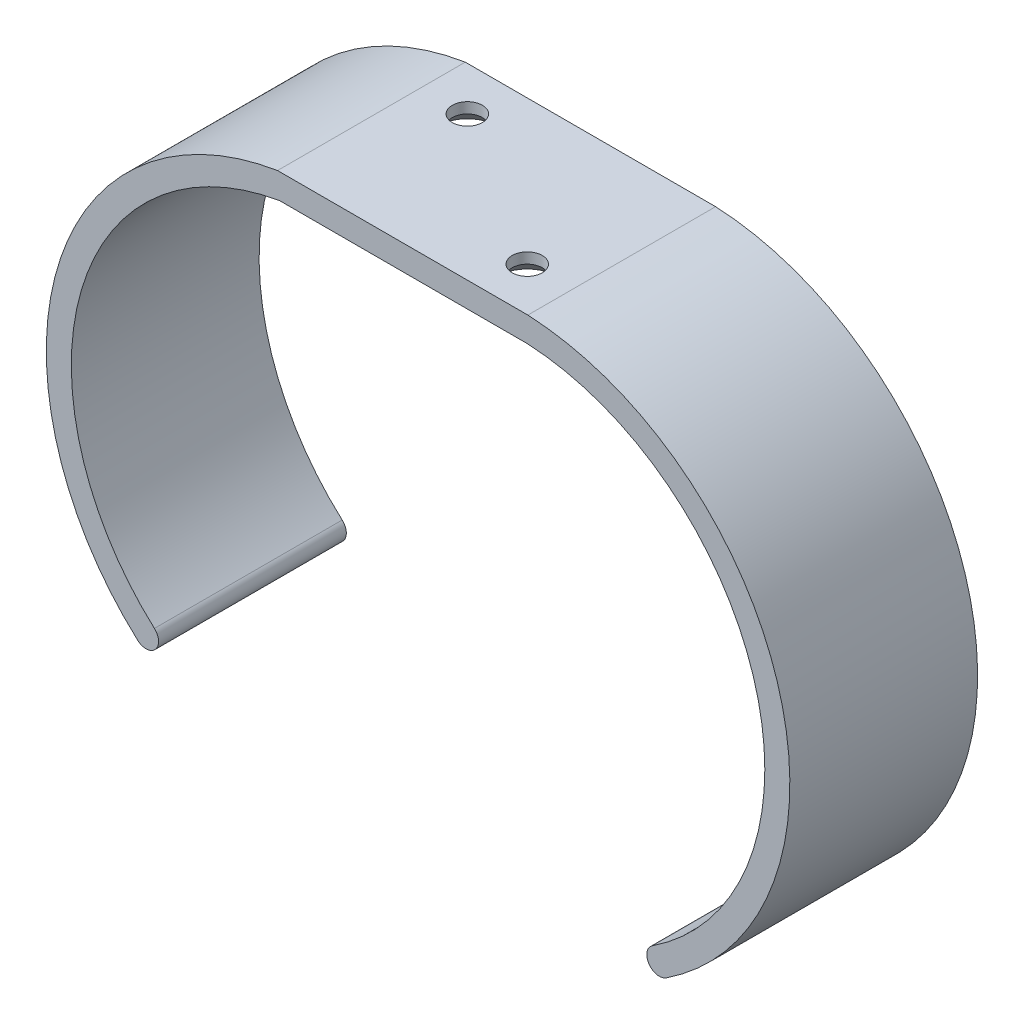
from build123d import *

# Parameters (mm, degrees)
BOSS_EXTRU_1_DEPTH                          = 30
FRAISAGE_POUR_VIS_T_TE_FRAIS_E_M41_AT_COUNT = 2
FRAISAGE_POUR_VIS_T_TE_FRAIS_E_M41_AT_PITCH = 30.163228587


with BuildPart() as part:
    # Esquisse1 → Boss.-Extru.1 (new body)
    with BuildSketch(Plane.XY):
        with BuildLine():
            Line((0, 0), (39.5699112, 0))
            ThreePointArc((39.5699112, 0), (76.12008281, -29.422530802), (59.5699112, -73.328022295))
            ThreePointArc((59.5699112, -73.328022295), (59.002916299, -76.099035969), (61.773929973, -76.66603087))
            ThreePointArc((61.773929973, -76.66603087), (79.965339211, -28.319586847), (39.669553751, 4))
            Line((39.669553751, 4), (-0.330446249, 4))
            ThreePointArc((-0.330446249, 4), (-35.49809959, -27.046914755), (-22.672317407, -72.17090027))
            ThreePointArc((-22.672317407, -72.17090027), (-19.847978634, -72.018878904), (-20, -69.194540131))
            ThreePointArc((-20, -69.194540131), (-31.703843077, -28.323988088), (0, 0))
        make_face()
    extrude(amount=BOSS_EXTRU_1_DEPTH)

    # Esquisse4 → Fraisage pour vis _ t_te frais_e M41 (revolve, cut)
    with BuildSketch(Plane(origin=(32.5699112, 0, 23), x_dir=(0, 0, -1), z_dir=(1, 0, 0))):
        Polygon((0, 0), (0, 4), (2.4, 4), (2.4, 2.3), (4.7, 0), align=None)
    fraisage_pour_vis_t_te_frais_e_m41 = revolve(axis=Axis((32.5699112, -6.35, 23), (0, 1, 0)), mode=Mode.SUBTRACT)

    # Fraisage pour vis _ t_te frais_e M41 at: Fraisage pour vis _ t_te frais_e M41 ×2
    with Locations(*[Vector(-0.8477179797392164, 0, -0.5304471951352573) * (i * FRAISAGE_POUR_VIS_T_TE_FRAIS_E_M41_AT_PITCH) for i in range(1, FRAISAGE_POUR_VIS_T_TE_FRAIS_E_M41_AT_COUNT)]):
        add(fraisage_pour_vis_t_te_frais_e_m41, mode=Mode.SUBTRACT)


solid = part.part
